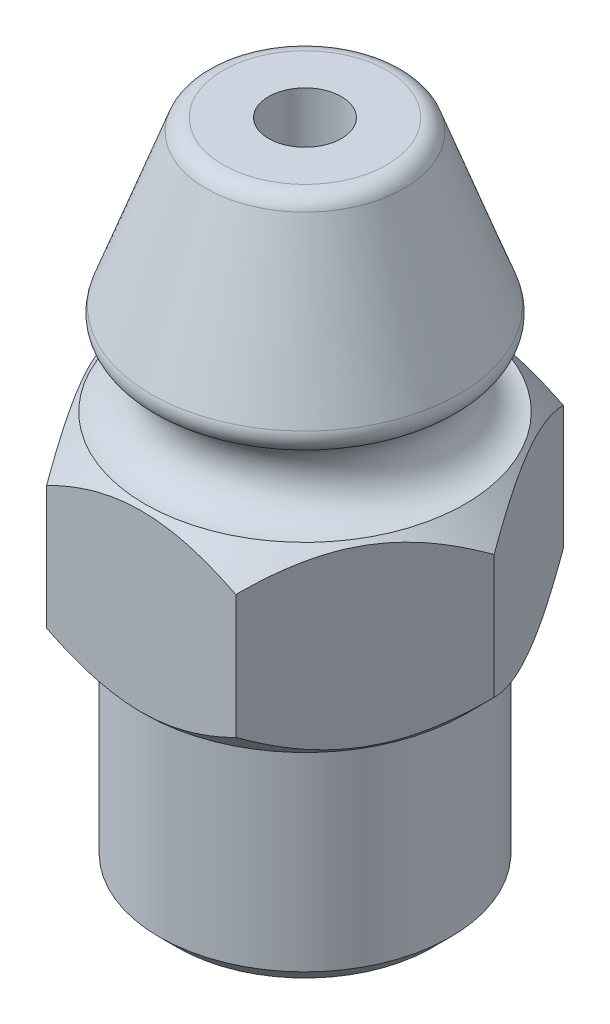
ISO-10303-21;
HEADER;
FILE_DESCRIPTION(('STEP AP214'),'2;1');
FILE_NAME('part.step','',(''),(''),'','','');
FILE_SCHEMA(('AUTOMOTIVE_DESIGN { 1 0 10303 214 1 1 1 1 }'));
ENDSEC;
DATA;
#1=APPLICATION_CONTEXT('core data for automotive mechanical design processes');
#2=APPLICATION_PROTOCOL_DEFINITION('international standard','automotive_design',2000,#1);
#3=PRODUCT_CONTEXT('',#1,'mechanical');
#4=PRODUCT('Part','Part','',(#3));
#5=PRODUCT_RELATED_PRODUCT_CATEGORY('part','',(#4));
#6=PRODUCT_DEFINITION_FORMATION('','',#4);
#7=PRODUCT_DEFINITION_CONTEXT('part definition',#1,'design');
#8=PRODUCT_DEFINITION('design','',#6,#7);
#9=PRODUCT_DEFINITION_SHAPE('','',#8);
#10=(LENGTH_UNIT() NAMED_UNIT(*) SI_UNIT(.MILLI.,.METRE.));
#11=(NAMED_UNIT(*) PLANE_ANGLE_UNIT() SI_UNIT($,.RADIAN.));
#12=(NAMED_UNIT(*) SI_UNIT($,.STERADIAN.) SOLID_ANGLE_UNIT());
#13=UNCERTAINTY_MEASURE_WITH_UNIT(LENGTH_MEASURE(1.E-05),#10,'distance_accuracy_value','');
#14=(GEOMETRIC_REPRESENTATION_CONTEXT(3) GLOBAL_UNCERTAINTY_ASSIGNED_CONTEXT((#13)) GLOBAL_UNIT_ASSIGNED_CONTEXT((#10,
#11,#12)) REPRESENTATION_CONTEXT('',''));
#15=CARTESIAN_POINT('',(0.,0.,0.));
#16=DIRECTION('',(0.,0.,1.));
#17=DIRECTION('',(1.,0.,0.));
#18=AXIS2_PLACEMENT_3D('',#15,#16,#17);
#19=CARTESIAN_POINT('',(-1.11022302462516E-13,-5.99999999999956,-5.55111512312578E-13));
#20=DIRECTION('',(0.,1.,0.));
#21=DIRECTION('',(0.,0.,1.));
#22=AXIS2_PLACEMENT_3D('',#19,#20,#21);
#23=CYLINDRICAL_SURFACE('',#22,4.);
#24=CARTESIAN_POINT('',(-1.11022302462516E-13,-5.49999999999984,0.));
#25=DIRECTION('',(0.,1.,0.));
#26=DIRECTION('',(0.,0.,1.));
#27=AXIS2_PLACEMENT_3D('',#24,#25,#26);
#28=CIRCLE('',#27,4.);
#29=CARTESIAN_POINT('',(-1.14130926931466E-13,-5.49999999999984,4.));
#30=VERTEX_POINT('',#29);
#31=EDGE_CURVE('E122',#30,#30,#28,.T.);
#32=ORIENTED_EDGE('',*,*,#31,.T.);
#33=EDGE_LOOP('',(#32));
#34=FACE_BOUND('',#33,.T.);
#35=CARTESIAN_POINT('',(0.,0.,0.));
#36=DIRECTION('',(0.,1.,0.));
#37=DIRECTION('',(0.,0.,1.));
#38=AXIS2_PLACEMENT_3D('',#35,#36,#37);
#39=CIRCLE('',#38,4.);
#40=CARTESIAN_POINT('',(0.,0.,4.));
#41=VERTEX_POINT('',#40);
#42=EDGE_CURVE('E119',#41,#41,#39,.T.);
#43=ORIENTED_EDGE('',*,*,#42,.F.);
#44=EDGE_LOOP('',(#43));
#45=FACE_BOUND('',#44,.T.);
#46=ADVANCED_FACE('F32',(#34,#45),#23,.T.);
#47=CARTESIAN_POINT('',(-1.11022302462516E-13,-5.99999999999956,-5.55111512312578E-13));
#48=DIRECTION('',(0.,1.,0.));
#49=DIRECTION('',(0.,0.,1.));
#50=AXIS2_PLACEMENT_3D('',#47,#48,#49);
#51=PLANE('',#50);
#52=CARTESIAN_POINT('',(-1.11022302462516E-13,-5.99999999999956,-5.55111512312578E-13));
#53=DIRECTION('',(0.,1.,0.));
#54=DIRECTION('',(0.,0.,1.));
#55=AXIS2_PLACEMENT_3D('',#52,#53,#54);
#56=CIRCLE('',#55,1.);
#57=CARTESIAN_POINT('',(-1.11799458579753E-13,-5.99999999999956,0.999999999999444));
#58=VERTEX_POINT('',#57);
#59=EDGE_CURVE('E395',#58,#58,#56,.T.);
#60=ORIENTED_EDGE('',*,*,#59,.T.);
#61=EDGE_LOOP('',(#60));
#62=FACE_BOUND('',#61,.T.);
#63=CARTESIAN_POINT('',(-1.11022302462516E-13,-5.99999999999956,-5.55111512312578E-13));
#64=DIRECTION('',(0.,1.,0.));
#65=DIRECTION('',(0.,0.,1.));
#66=AXIS2_PLACEMENT_3D('',#63,#64,#65);
#67=CIRCLE('',#66,3.5);
#68=CARTESIAN_POINT('',(-1.13742348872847E-13,-5.99999999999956,3.49999999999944));
#69=VERTEX_POINT('',#68);
#70=EDGE_CURVE('E125',#69,#69,#67,.F.);
#71=ORIENTED_EDGE('',*,*,#70,.T.);
#72=EDGE_LOOP('',(#71));
#73=FACE_BOUND('',#72,.T.);
#74=ADVANCED_FACE('F161',(#62,#73),#51,.F.);
#75=CARTESIAN_POINT('',(-1.11022302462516E-13,-5.49999999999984,0.));
#76=DIRECTION('',(0.,1.,0.));
#77=DIRECTION('',(0.,0.,1.));
#78=AXIS2_PLACEMENT_3D('',#75,#76,#77);
#79=CONICAL_SURFACE('',#78,4.,0.78539816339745);
#80=ORIENTED_EDGE('',*,*,#70,.F.);
#81=EDGE_LOOP('',(#80));
#82=FACE_BOUND('',#81,.T.);
#83=ORIENTED_EDGE('',*,*,#31,.F.);
#84=EDGE_LOOP('',(#83));
#85=FACE_BOUND('',#84,.T.);
#86=ADVANCED_FACE('F166',(#82,#85),#79,.T.);
#87=CARTESIAN_POINT('',(-7.79422863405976,2.22044604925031E-13,4.50000000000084));
#88=DIRECTION('',(0.,1.,0.));
#89=DIRECTION('',(0.,0.,1.));
#90=AXIS2_PLACEMENT_3D('',#87,#88,#89);
#91=PLANE('',#90);
#92=CARTESIAN_POINT('',(0.,0.,0.));
#93=DIRECTION('',(0.,-1.,0.));
#94=DIRECTION('',(0.,0.,-1.));
#95=AXIS2_PLACEMENT_3D('',#92,#93,#94);
#96=CIRCLE('',#95,4.39615242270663);
#97=CARTESIAN_POINT('',(0.,0.,-4.39615242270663));
#98=VERTEX_POINT('',#97);
#99=EDGE_CURVE('E90',#98,#98,#96,.T.);
#100=ORIENTED_EDGE('',*,*,#99,.T.);
#101=EDGE_LOOP('',(#100));
#102=FACE_BOUND('',#101,.T.);
#103=ORIENTED_EDGE('',*,*,#42,.T.);
#104=EDGE_LOOP('',(#103));
#105=FACE_BOUND('',#104,.T.);
#106=ADVANCED_FACE('F172',(#102,#105),#91,.F.);
#107=CARTESIAN_POINT('',(0.,0.,0.));
#108=DIRECTION('',(0.,1.,0.));
#109=DIRECTION('',(0.,0.,-1.));
#110=AXIS2_PLACEMENT_3D('',#107,#108,#109);
#111=CONICAL_SURFACE('',#110,4.39615242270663,0.785398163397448);
#112=ORIENTED_EDGE('',*,*,#99,.F.);
#113=EDGE_LOOP('',(#112));
#114=FACE_BOUND('',#113,.T.);
#115=CARTESIAN_POINT('',(-5.38014089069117,2.617827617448,-4.49999999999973));
#116=CARTESIAN_POINT('',(-5.24999635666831,2.51802146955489,-4.50000000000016));
#117=CARTESIAN_POINT('',(-5.11914584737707,2.41912134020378,-4.50000000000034));
#118=CARTESIAN_POINT('',(-4.85574603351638,2.22354564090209,-4.50000000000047));
#119=CARTESIAN_POINT('',(-4.72319633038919,2.12687060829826,-4.50000000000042));
#120=CARTESIAN_POINT('',(-4.45514222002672,1.93546955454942,-4.50000000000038));
#121=CARTESIAN_POINT('',(-4.31962290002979,1.84076434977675,-4.5000000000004));
#122=CARTESIAN_POINT('',(-4.04632074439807,1.65468947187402,-4.5000000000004));
#123=CARTESIAN_POINT('',(-3.90853806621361,1.56331956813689,-4.5000000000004));
#124=CARTESIAN_POINT('',(-3.62166392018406,1.37910595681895,-4.5000000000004));
#125=CARTESIAN_POINT('',(-3.47240275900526,1.28652518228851,-4.50000000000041));
#126=CARTESIAN_POINT('',(-3.17037815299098,1.10716739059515,-4.50000000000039));
#127=CARTESIAN_POINT('',(-3.01761413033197,1.02039134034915,-4.50000000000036));
#128=CARTESIAN_POINT('',(-2.70855161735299,0.854495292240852,-4.50000000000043));
#129=CARTESIAN_POINT('',(-2.5522652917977,0.775352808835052,-4.50000000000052));
#130=CARTESIAN_POINT('',(-2.23530058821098,0.626496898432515,-4.50000000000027));
#131=CARTESIAN_POINT('',(-2.07462431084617,0.556779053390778,-4.49999999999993));
#132=CARTESIAN_POINT('',(-1.76414619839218,0.435391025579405,-4.49999999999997));
#133=CARTESIAN_POINT('',(-1.61477429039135,0.38263241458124,-4.50000000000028));
#134=CARTESIAN_POINT('',(-1.31226064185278,0.289075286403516,-4.50000000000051));
#135=CARTESIAN_POINT('',(-1.15911865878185,0.248277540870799,-4.50000000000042));
#136=CARTESIAN_POINT('',(-0.852625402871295,0.181516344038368,-4.50000000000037));
#137=CARTESIAN_POINT('',(-0.699333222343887,0.155286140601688,-4.50000000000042));
#138=CARTESIAN_POINT('',(-0.390889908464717,0.118201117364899,-4.50000000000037));
#139=CARTESIAN_POINT('',(-0.235739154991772,0.107343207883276,-4.50000000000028));
#140=CARTESIAN_POINT('',(0.0682756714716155,0.101907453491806,-4.50000000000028));
#141=CARTESIAN_POINT('',(0.217127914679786,0.106660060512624,-4.50000000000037));
#142=CARTESIAN_POINT('',(0.513651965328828,0.130655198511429,-4.50000000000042));
#143=CARTESIAN_POINT('',(0.661323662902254,0.149899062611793,-4.50000000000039));
#144=CARTESIAN_POINT('',(0.956919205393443,0.202122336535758,-4.5000000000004));
#145=CARTESIAN_POINT('',(1.10479975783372,0.235342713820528,-4.50000000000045));
#146=CARTESIAN_POINT('',(1.39731083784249,0.313688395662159,-4.50000000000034));
#147=CARTESIAN_POINT('',(1.5419415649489,0.35881296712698,-4.50000000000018));
#148=CARTESIAN_POINT('',(1.83674972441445,0.462179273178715,-4.50000000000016));
#149=CARTESIAN_POINT('',(1.98669638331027,0.521071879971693,-4.50000000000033));
#150=CARTESIAN_POINT('',(2.28272734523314,0.64794743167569,-4.50000000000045));
#151=CARTESIAN_POINT('',(2.42880986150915,0.715934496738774,-4.50000000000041));
#152=CARTESIAN_POINT('',(2.71780602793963,0.859385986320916,-4.50000000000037));
#153=CARTESIAN_POINT('',(2.86070811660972,0.934873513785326,-4.50000000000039));
#154=CARTESIAN_POINT('',(3.14323571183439,1.09166360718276,-4.5000000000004));
#155=CARTESIAN_POINT('',(3.28286172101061,1.17296527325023,-4.50000000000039));
#156=CARTESIAN_POINT('',(3.55243568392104,1.33611300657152,-4.50000000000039));
#157=CARTESIAN_POINT('',(3.68252087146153,1.41773351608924,-4.50000000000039));
#158=CARTESIAN_POINT('',(3.94045649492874,1.58444271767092,-4.50000000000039));
#159=CARTESIAN_POINT('',(4.06830676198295,1.66953167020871,-4.50000000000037));
#160=CARTESIAN_POINT('',(4.32103563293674,1.84186477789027,-4.50000000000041));
#161=CARTESIAN_POINT('',(4.44592986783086,1.92908609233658,-4.50000000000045));
#162=CARTESIAN_POINT('',(4.69400587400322,2.10586228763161,-4.50000000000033));
#163=CARTESIAN_POINT('',(4.81718810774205,2.1954165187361,-4.50000000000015));
#164=CARTESIAN_POINT('',(4.93965236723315,2.28592551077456,-4.49999999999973));
#165=B_SPLINE_CURVE_WITH_KNOTS('',3,(#115,#116,#117,#118,#119,#120,#121,#122,#123,#124,#125,
#126,#127,#128,#129,#130,#131,#132,#133,#134,#135,#136,#137,#138,#139,#140,#141,#142,#143,#144,
#145,#146,#147,#148,#149,#150,#151,#152,#153,#154,#155,#156,#157,#158,#159,#160,#161,#162,#163,
#164),.UNSPECIFIED.,.F.,.F.,(4,2,2,2,2,2,2,2,2,2,2,2,2,2,2,2,2,2,2,2,2,2,2,2,4),(0.,
0.492035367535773,0.984188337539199,1.48014191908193,1.97606114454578,2.50288203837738,
3.02979046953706,3.55509613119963,4.08015468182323,4.55498998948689,5.02985592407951,
5.49571268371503,5.96147579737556,6.4075271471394,6.85361953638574,7.30774031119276,
7.7618331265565,8.24475382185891,8.72789404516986,9.21257150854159,9.69717411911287,
10.1578227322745,10.6185060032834,11.0754837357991,11.5323355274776),.UNSPECIFIED.);
#166=CARTESIAN_POINT('',(2.59807621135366,0.800000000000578,-4.50000000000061));
#167=VERTEX_POINT('',#166);
#168=CARTESIAN_POINT('',(-2.59807621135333,0.8000000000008,-4.50000000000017));
#169=VERTEX_POINT('',#168);
#170=EDGE_CURVE('E81',#167,#169,#165,.F.);
#171=ORIENTED_EDGE('',*,*,#170,.F.);
#172=CARTESIAN_POINT('',(5.19626789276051,0.80011547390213,0.000200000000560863));
#173=CARTESIAN_POINT('',(5.1515947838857,0.755446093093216,-0.0771760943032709));
#174=CARTESIAN_POINT('',(5.106578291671,0.712147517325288,-0.155146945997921));
#175=CARTESIAN_POINT('',(5.01579116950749,0.628708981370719,-0.312394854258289));
#176=CARTESIAN_POINT('',(4.97002014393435,0.588570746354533,-0.391672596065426));
#177=CARTESIAN_POINT('',(4.83104895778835,0.473179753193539,-0.632377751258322));
#178=CARTESIAN_POINT('',(4.73667231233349,0.40344300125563,-0.795842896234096));
#179=CARTESIAN_POINT('',(4.54635423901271,0.284023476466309,-1.12548346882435));
#180=CARTESIAN_POINT('',(4.45046145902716,0.234039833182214,-1.29157463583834));
#181=CARTESIAN_POINT('',(4.30504571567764,0.176220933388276,-1.54344209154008));
#182=CARTESIAN_POINT('',(4.25635970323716,0.1598151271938,-1.62776873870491));
#183=CARTESIAN_POINT('',(4.15857543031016,0.133093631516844,-1.79713606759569));
#184=CARTESIAN_POINT('',(4.10947723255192,0.12277703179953,-1.88217664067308));
#185=CARTESIAN_POINT('',(3.98983326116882,0.105479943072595,-2.08940607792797));
#186=CARTESIAN_POINT('',(3.91915857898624,0.101850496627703,-2.21181821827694));
#187=CARTESIAN_POINT('',(3.77793657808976,0.107941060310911,-2.45642189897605));
#188=CARTESIAN_POINT('',(3.70738931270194,0.11766575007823,-2.57861334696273));
#189=CARTESIAN_POINT('',(3.56695987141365,0.149891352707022,-2.82184427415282));
#190=CARTESIAN_POINT('',(3.49707852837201,0.172406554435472,-2.94288231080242));
#191=CARTESIAN_POINT('',(3.35851692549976,0.228989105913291,-3.18287804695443));
#192=CARTESIAN_POINT('',(3.28983657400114,0.263055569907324,-3.30183590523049));
#193=CARTESIAN_POINT('',(3.16791360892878,0.333142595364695,-3.51301267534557));
#194=CARTESIAN_POINT('',(3.11440108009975,0.367320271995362,-3.60569909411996));
#195=CARTESIAN_POINT('',(3.00833668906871,0.441183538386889,-3.7894080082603));
#196=CARTESIAN_POINT('',(2.95578485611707,0.480869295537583,-3.88043045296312));
#197=CARTESIAN_POINT('',(2.85180737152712,0.564859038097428,-4.06052473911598));
#198=CARTESIAN_POINT('',(2.8003787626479,0.609148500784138,-4.14960170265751));
#199=CARTESIAN_POINT('',(2.69847391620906,0.701764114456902,-4.32610607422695));
#200=CARTESIAN_POINT('',(2.64799711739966,0.750087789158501,-4.413534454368));
#201=CARTESIAN_POINT('',(2.59796074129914,0.800115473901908,-4.50019999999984));
#202=B_SPLINE_CURVE_WITH_KNOTS('',3,(#172,#173,#174,#175,#176,#177,#178,#179,#180,#181,#182,
#183,#184,#185,#186,#187,#188,#189,#190,#191,#192,#193,#194,#195,#196,#197,#198,#199,#200,#201),
.UNSPECIFIED.,.F.,.F.,(4,2,2,2,2,2,2,2,2,2,2,2,2,2,4),(0.,0.299653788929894,0.599470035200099,
1.20233965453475,1.79563573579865,2.09170187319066,2.38772374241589,2.81125251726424,
3.23492974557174,3.65908121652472,4.08320017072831,4.42009140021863,4.75699287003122,
5.09286208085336,5.42852662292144),.UNSPECIFIED.);
#203=CARTESIAN_POINT('',(5.19615242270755,0.800000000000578,6.66133814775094E-13));
#204=VERTEX_POINT('',#203);
#205=EDGE_CURVE('E84',#204,#167,#202,.T.);
#206=ORIENTED_EDGE('',*,*,#205,.F.);
#207=CARTESIAN_POINT('',(2.59796074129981,0.800115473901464,4.50020000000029));
#208=CARTESIAN_POINT('',(2.64263385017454,0.75544609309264,4.42282390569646));
#209=CARTESIAN_POINT('',(2.68765034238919,0.712147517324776,4.34485305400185));
#210=CARTESIAN_POINT('',(2.77843746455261,0.628708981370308,4.1876051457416));
#211=CARTESIAN_POINT('',(2.82420849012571,0.588570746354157,4.10832740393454));
#212=CARTESIAN_POINT('',(2.96317967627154,0.473179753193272,3.86762224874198));
#213=CARTESIAN_POINT('',(3.05755632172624,0.403443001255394,3.70415710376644));
#214=CARTESIAN_POINT('',(3.24787439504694,0.284023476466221,3.37451653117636));
#215=CARTESIAN_POINT('',(3.34376717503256,0.234039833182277,3.20842536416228));
#216=CARTESIAN_POINT('',(3.4891829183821,0.176220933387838,2.95655790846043));
#217=CARTESIAN_POINT('',(3.53786893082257,0.159815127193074,2.87223126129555));
#218=CARTESIAN_POINT('',(3.63565320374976,0.133093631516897,2.7028639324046));
#219=CARTESIAN_POINT('',(3.6847514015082,0.122777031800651,2.61782335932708));
#220=CARTESIAN_POINT('',(3.80439537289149,0.105479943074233,2.41059392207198));
#221=CARTESIAN_POINT('',(3.87507005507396,0.101850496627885,2.28818178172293));
#222=CARTESIAN_POINT('',(4.01629205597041,0.107941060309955,2.04357810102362));
#223=CARTESIAN_POINT('',(4.08683932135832,0.117665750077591,1.92138665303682));
#224=CARTESIAN_POINT('',(4.22726876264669,0.149891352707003,1.67815572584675));
#225=CARTESIAN_POINT('',(4.29715010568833,0.172406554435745,1.55711768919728));
#226=CARTESIAN_POINT('',(4.43571170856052,0.228989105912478,1.31712195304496));
#227=CARTESIAN_POINT('',(4.50439206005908,0.263055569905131,1.19816409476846));
#228=CARTESIAN_POINT('',(4.62631502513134,0.33314259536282,0.986987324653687));
#229=CARTESIAN_POINT('',(4.67982755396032,0.367320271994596,0.894300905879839));
#230=CARTESIAN_POINT('',(4.78589194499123,0.441183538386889,0.710591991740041));
#231=CARTESIAN_POINT('',(4.8384437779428,0.480869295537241,0.619569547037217));
#232=CARTESIAN_POINT('',(4.94242126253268,0.564859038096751,0.439475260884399));
#233=CARTESIAN_POINT('',(4.99384987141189,0.609148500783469,0.350398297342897));
#234=CARTESIAN_POINT('',(5.09575471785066,0.70176411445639,0.17389392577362));
#235=CARTESIAN_POINT('',(5.14623151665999,0.750087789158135,0.0864655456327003));
#236=CARTESIAN_POINT('',(5.1962678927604,0.800115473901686,-0.00019999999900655));
#237=B_SPLINE_CURVE_WITH_KNOTS('',3,(#207,#208,#209,#210,#211,#212,#213,#214,#215,#216,#217,
#218,#219,#220,#221,#222,#223,#224,#225,#226,#227,#228,#229,#230,#231,#232,#233,#234,#235,#236),
.UNSPECIFIED.,.F.,.F.,(4,2,2,2,2,2,2,2,2,2,2,2,2,2,4),(0.,0.299653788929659,0.599470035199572,
1.20233965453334,1.79563573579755,2.09170187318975,2.38772374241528,2.81125251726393,
3.2349297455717,3.65908121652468,4.0832001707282,4.42009140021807,4.75699287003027,
5.0928620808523,5.42852662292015),.UNSPECIFIED.);
#238=CARTESIAN_POINT('',(2.59807621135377,0.79999999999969,4.49999999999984));
#239=VERTEX_POINT('',#238);
#240=EDGE_CURVE('E99',#239,#204,#237,.T.);
#241=ORIENTED_EDGE('',*,*,#240,.F.);
#242=CARTESIAN_POINT('',(-5.38014089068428,2.61782761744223,4.50000000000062));
#243=CARTESIAN_POINT('',(-5.24999635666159,2.51802146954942,4.50000000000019));
#244=CARTESIAN_POINT('',(-5.11914584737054,2.41912134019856,4.50000000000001));
#245=CARTESIAN_POINT('',(-4.85574603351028,2.22354564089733,4.49999999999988));
#246=CARTESIAN_POINT('',(-4.72319633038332,2.12687060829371,4.49999999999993));
#247=CARTESIAN_POINT('',(-4.45514222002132,1.93546955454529,4.49999999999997));
#248=CARTESIAN_POINT('',(-4.31962290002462,1.84076434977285,4.49999999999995));
#249=CARTESIAN_POINT('',(-4.04632074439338,1.65468947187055,4.49999999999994));
#250=CARTESIAN_POINT('',(-3.90853806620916,1.56331956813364,4.49999999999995));
#251=CARTESIAN_POINT('',(-3.62166392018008,1.37910595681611,4.49999999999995));
#252=CARTESIAN_POINT('',(-3.47240275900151,1.28652518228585,4.49999999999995));
#253=CARTESIAN_POINT('',(-3.17037815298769,1.1071673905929,4.49999999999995));
#254=CARTESIAN_POINT('',(-3.01761413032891,1.0203913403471,4.49999999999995));
#255=CARTESIAN_POINT('',(-2.70855161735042,0.854495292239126,4.49999999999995));
#256=CARTESIAN_POINT('',(-2.5522652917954,0.775352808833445,4.49999999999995));
#257=CARTESIAN_POINT('',(-2.23530058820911,0.626496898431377,4.49999999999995));
#258=CARTESIAN_POINT('',(-2.07462431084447,0.55677905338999,4.49999999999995));
#259=CARTESIAN_POINT('',(-1.76414619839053,0.435391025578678,4.49999999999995));
#260=CARTESIAN_POINT('',(-1.61477429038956,0.382632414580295,4.49999999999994));
#261=CARTESIAN_POINT('',(-1.31226064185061,0.28907528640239,4.49999999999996));
#262=CARTESIAN_POINT('',(-1.15911865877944,0.24827754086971,4.49999999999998));
#263=CARTESIAN_POINT('',(-0.852625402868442,0.181516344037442,4.49999999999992));
#264=CARTESIAN_POINT('',(-0.699333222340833,0.155286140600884,4.49999999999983));
#265=CARTESIAN_POINT('',(-0.390889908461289,0.118201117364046,4.50000000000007));
#266=CARTESIAN_POINT('',(-0.235739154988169,0.107343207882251,4.50000000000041));
#267=CARTESIAN_POINT('',(0.0682756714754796,0.10190745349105,4.50000000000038));
#268=CARTESIAN_POINT('',(0.217127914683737,0.106660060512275,4.50000000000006));
#269=CARTESIAN_POINT('',(0.513651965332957,0.130655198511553,4.49999999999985));
#270=CARTESIAN_POINT('',(0.661323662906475,0.149899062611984,4.49999999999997));
#271=CARTESIAN_POINT('',(0.956919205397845,0.202122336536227,4.49999999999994));
#272=CARTESIAN_POINT('',(1.10479975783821,0.235342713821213,4.49999999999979));
#273=CARTESIAN_POINT('',(1.39731083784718,0.313688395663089,4.50000000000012));
#274=CARTESIAN_POINT('',(1.54194156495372,0.358812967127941,4.5000000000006));
#275=CARTESIAN_POINT('',(1.83674972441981,0.462179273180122,4.50000000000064));
#276=CARTESIAN_POINT('',(1.98669638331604,0.52107187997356,4.50000000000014));
#277=CARTESIAN_POINT('',(2.28272734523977,0.647947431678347,4.49999999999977));
#278=CARTESIAN_POINT('',(2.42880986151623,0.715934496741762,4.49999999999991));
#279=CARTESIAN_POINT('',(2.7178060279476,0.85938598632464,4.50000000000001));
#280=CARTESIAN_POINT('',(2.86070811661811,0.934873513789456,4.49999999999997));
#281=CARTESIAN_POINT('',(3.14323571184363,1.0916636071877,4.49999999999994));
#282=CARTESIAN_POINT('',(3.28286172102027,1.17296527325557,4.49999999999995));
#283=CARTESIAN_POINT('',(3.55243568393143,1.33611300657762,4.49999999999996));
#284=CARTESIAN_POINT('',(3.68252087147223,1.41773351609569,4.49999999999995));
#285=CARTESIAN_POINT('',(3.94045649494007,1.58444271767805,4.49999999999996));
#286=CARTESIAN_POINT('',(4.06830676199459,1.66953167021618,4.49999999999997));
#287=CARTESIAN_POINT('',(4.32103563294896,1.84186477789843,4.49999999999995));
#288=CARTESIAN_POINT('',(4.44592986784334,1.92908609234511,4.49999999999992));
#289=CARTESIAN_POINT('',(4.69400587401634,2.10586228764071,4.5));
#290=CARTESIAN_POINT('',(4.81718810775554,2.1954165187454,4.50000000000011));
#291=CARTESIAN_POINT('',(4.93965236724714,2.28592551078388,4.50000000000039));
#292=B_SPLINE_CURVE_WITH_KNOTS('',3,(#242,#243,#244,#245,#246,#247,#248,#249,#250,#251,#252,
#253,#254,#255,#256,#257,#258,#259,#260,#261,#262,#263,#264,#265,#266,#267,#268,#269,#270,#271,
#272,#273,#274,#275,#276,#277,#278,#279,#280,#281,#282,#283,#284,#285,#286,#287,#288,#289,#290,
#291),.UNSPECIFIED.,.F.,.F.,(4,2,2,2,2,2,2,2,2,2,2,2,2,2,2,2,2,2,2,2,2,2,2,2,4),(0.,
0.492035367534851,0.984188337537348,1.48014191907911,1.97606114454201,2.50288203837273,
3.02979046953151,3.55509613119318,4.08015468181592,4.55498998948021,5.02985592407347,
5.49571268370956,5.96147579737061,6.40752714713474,6.8536195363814,7.30774031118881,
7.76183312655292,8.24475382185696,8.72789404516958,9.212571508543,9.69717411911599,
10.157822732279,10.6185060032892,11.0754837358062,11.5323355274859),.UNSPECIFIED.);
#293=CARTESIAN_POINT('',(-2.59807621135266,0.799999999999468,4.50000000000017));
#294=VERTEX_POINT('',#293);
#295=EDGE_CURVE('E220',#294,#239,#292,.T.);
#296=ORIENTED_EDGE('',*,*,#295,.F.);
#297=CARTESIAN_POINT('',(-5.19626789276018,0.800115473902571,-0.00019999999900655));
#298=CARTESIAN_POINT('',(-5.15159478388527,0.755446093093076,0.0771760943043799));
#299=CARTESIAN_POINT('',(-5.10657829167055,0.712147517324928,0.155146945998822));
#300=CARTESIAN_POINT('',(-5.01579116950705,0.628708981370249,0.312394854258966));
#301=CARTESIAN_POINT('',(-4.97002014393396,0.588570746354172,0.391672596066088));
#302=CARTESIAN_POINT('',(-4.83104895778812,0.47317975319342,0.63237775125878));
#303=CARTESIAN_POINT('',(-4.73667231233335,0.403443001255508,0.795842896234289));
#304=CARTESIAN_POINT('',(-4.54635423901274,0.284023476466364,1.12548346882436));
#305=CARTESIAN_POINT('',(-4.45046145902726,0.234039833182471,1.29157463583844));
#306=CARTESIAN_POINT('',(-4.30504571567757,0.17622093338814,1.54344209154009));
#307=CARTESIAN_POINT('',(-4.25635970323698,0.159815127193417,1.62776873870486));
#308=CARTESIAN_POINT('',(-4.15857543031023,0.133093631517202,1.79713606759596));
#309=CARTESIAN_POINT('',(-4.10947723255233,0.122777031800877,1.88217664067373));
#310=CARTESIAN_POINT('',(-3.98983326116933,0.105479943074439,2.0894060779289));
#311=CARTESIAN_POINT('',(-3.91915857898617,0.101850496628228,2.21181821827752));
#312=CARTESIAN_POINT('',(-3.77793657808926,0.107941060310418,2.45642189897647));
#313=CARTESIAN_POINT('',(-3.70738931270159,0.117665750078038,2.57861334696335));
#314=CARTESIAN_POINT('',(-3.56695987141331,0.149891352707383,2.82184427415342));
#315=CARTESIAN_POINT('',(-3.49707852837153,0.172406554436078,2.94288231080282));
#316=CARTESIAN_POINT('',(-3.35851692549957,0.228989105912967,3.18287804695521));
#317=CARTESIAN_POINT('',(-3.28983657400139,0.263055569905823,3.30183590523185));
#318=CARTESIAN_POINT('',(-3.16791360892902,0.333142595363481,3.51301267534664));
#319=CARTESIAN_POINT('',(-3.11440108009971,0.367320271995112,3.60569909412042));
#320=CARTESIAN_POINT('',(-3.00833668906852,0.441183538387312,3.78940800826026));
#321=CARTESIAN_POINT('',(-2.95578485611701,0.480869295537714,3.88043045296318));
#322=CARTESIAN_POINT('',(-2.85180737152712,0.564859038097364,4.06052473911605));
#323=CARTESIAN_POINT('',(-2.80037876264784,0.609148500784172,4.14960170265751));
#324=CARTESIAN_POINT('',(-2.69847391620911,0.701764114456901,4.32610607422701));
#325=CARTESIAN_POINT('',(-2.64799711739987,0.750087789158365,4.41353445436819));
#326=CARTESIAN_POINT('',(-2.59796074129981,0.800115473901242,4.50020000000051));
#327=B_SPLINE_CURVE_WITH_KNOTS('',3,(#297,#298,#299,#300,#301,#302,#303,#304,#305,#306,#307,
#308,#309,#310,#311,#312,#313,#314,#315,#316,#317,#318,#319,#320,#321,#322,#323,#324,#325,#326),
.UNSPECIFIED.,.F.,.F.,(4,2,2,2,2,2,2,2,2,2,2,2,2,2,4),(0.,0.299653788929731,0.5994700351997,
1.20233965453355,1.79563573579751,2.09170187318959,2.387723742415,2.81125251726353,
3.23492974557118,3.65908121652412,4.08320017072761,4.42009140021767,4.75699287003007,
5.09286208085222,5.42852662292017),.UNSPECIFIED.);
#328=CARTESIAN_POINT('',(-5.19615242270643,0.799999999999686,5.55111512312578E-13));
#329=VERTEX_POINT('',#328);
#330=EDGE_CURVE('E226',#329,#294,#327,.T.);
#331=ORIENTED_EDGE('',*,*,#330,.F.);
#332=CARTESIAN_POINT('',(-2.59796074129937,0.800115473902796,-4.50020000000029));
#333=CARTESIAN_POINT('',(-2.64263385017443,0.755446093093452,-4.42282390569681));
#334=CARTESIAN_POINT('',(-2.68765034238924,0.712147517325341,-4.3448530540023));
#335=CARTESIAN_POINT('',(-2.77843746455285,0.628708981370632,-4.18760514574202));
#336=CARTESIAN_POINT('',(-2.82420849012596,0.588570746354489,-4.10832740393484));
#337=CARTESIAN_POINT('',(-2.96317967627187,0.473179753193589,-3.86762224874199));
#338=CARTESIAN_POINT('',(-3.05755632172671,0.403443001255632,-3.70415710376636));
#339=CARTESIAN_POINT('',(-3.24787439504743,0.284023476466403,-3.37451653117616));
#340=CARTESIAN_POINT('',(-3.34376717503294,0.234039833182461,-3.20842536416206));
#341=CARTESIAN_POINT('',(-3.48918291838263,0.17622093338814,-2.95655790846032));
#342=CARTESIAN_POINT('',(-3.53786893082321,0.159815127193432,-2.87223126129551));
#343=CARTESIAN_POINT('',(-3.63565320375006,0.133093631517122,-2.7028639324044));
#344=CARTESIAN_POINT('',(-3.68475140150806,0.122777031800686,-2.61782335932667));
#345=CARTESIAN_POINT('',(-3.80439537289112,0.105479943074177,-2.41059392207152));
#346=CARTESIAN_POINT('',(-3.87507005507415,0.101850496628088,-2.28818178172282));
#347=CARTESIAN_POINT('',(-4.01629205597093,0.107941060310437,-2.04357810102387));
#348=CARTESIAN_POINT('',(-4.08683932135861,0.117665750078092,-1.92138665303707));
#349=CARTESIAN_POINT('',(-4.22726876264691,0.149891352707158,-1.678155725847));
#350=CARTESIAN_POINT('',(-4.2971501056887,0.172406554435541,-1.55711768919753));
#351=CARTESIAN_POINT('',(-4.43571170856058,0.22898910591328,-1.31712195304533));
#352=CARTESIAN_POINT('',(-4.50439206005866,0.263055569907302,-1.19816409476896));
#353=CARTESIAN_POINT('',(-4.62631502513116,0.333142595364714,-0.986987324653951));
#354=CARTESIAN_POINT('',(-4.67982755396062,0.367320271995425,-0.894300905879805));
#355=CARTESIAN_POINT('',(-4.78589194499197,0.441183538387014,-0.710591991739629));
#356=CARTESIAN_POINT('',(-4.83844377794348,0.480869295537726,-0.619569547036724));
#357=CARTESIAN_POINT('',(-4.94242126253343,0.564859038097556,-0.439475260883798));
#358=CARTESIAN_POINT('',(-4.99384987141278,0.609148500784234,-0.350398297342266));
#359=CARTESIAN_POINT('',(-5.09575471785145,0.701764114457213,-0.173893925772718));
#360=CARTESIAN_POINT('',(-5.14623151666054,0.750087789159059,-0.0864655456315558));
#361=CARTESIAN_POINT('',(-5.19626789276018,0.800115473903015,0.000200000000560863));
#362=B_SPLINE_CURVE_WITH_KNOTS('',3,(#332,#333,#334,#335,#336,#337,#338,#339,#340,#341,#342,
#343,#344,#345,#346,#347,#348,#349,#350,#351,#352,#353,#354,#355,#356,#357,#358,#359,#360,#361),
.UNSPECIFIED.,.F.,.F.,(4,2,2,2,2,2,2,2,2,2,2,2,2,2,4),(0.,0.299653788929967,0.599470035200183,
1.20233965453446,1.79563573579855,2.09170187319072,2.38772374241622,2.81125251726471,
3.23492974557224,3.65908121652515,4.08320017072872,4.4200914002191,4.75699287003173,
5.09286208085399,5.42852662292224),.UNSPECIFIED.);
#363=EDGE_CURVE('E46',#169,#329,#362,.T.);
#364=ORIENTED_EDGE('',*,*,#363,.F.);
#365=EDGE_LOOP('',(#171,#206,#241,#296,#331,#364));
#366=FACE_BOUND('',#365,.T.);
#367=ADVANCED_FACE('F83',(#114,#366),#111,.T.);
#368=CARTESIAN_POINT('',(2.22044604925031E-13,5.00000000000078,-4.44089209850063E-13));
#369=DIRECTION('',(0.,-1.,0.));
#370=DIRECTION('',(0.,0.,-1.));
#371=AXIS2_PLACEMENT_3D('',#368,#369,#370);
#372=CONICAL_SURFACE('',#371,4.39615242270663,0.785398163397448);
#373=CARTESIAN_POINT('',(2.22044604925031E-13,5.00000000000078,-4.44089209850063E-13));
#374=DIRECTION('',(0.,1.,0.));
#375=DIRECTION('',(0.,0.,1.));
#376=AXIS2_PLACEMENT_3D('',#373,#374,#375);
#377=CIRCLE('',#376,4.39615242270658);
#378=CARTESIAN_POINT('',(2.18628108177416E-13,5.00000000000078,4.39615242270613));
#379=VERTEX_POINT('',#378);
#380=EDGE_CURVE('E399',#379,#379,#377,.T.);
#381=ORIENTED_EDGE('',*,*,#380,.F.);
#382=EDGE_LOOP('',(#381));
#383=FACE_BOUND('',#382,.T.);
#384=CARTESIAN_POINT('',(-2.59796074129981,4.19988452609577,4.50020000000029));
#385=CARTESIAN_POINT('',(-2.64263385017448,4.24455390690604,4.42282390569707));
#386=CARTESIAN_POINT('',(-2.68765034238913,4.28785248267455,4.34485305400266));
#387=CARTESIAN_POINT('',(-2.77843746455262,4.37129101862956,4.18760514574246));
#388=CARTESIAN_POINT('',(-2.82420849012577,4.41142925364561,4.10832740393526));
#389=CARTESIAN_POINT('',(-2.96317967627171,4.52682024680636,3.86762224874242));
#390=CARTESIAN_POINT('',(-3.05755632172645,4.59655699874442,3.70415710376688));
#391=CARTESIAN_POINT('',(-3.24787439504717,4.71597652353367,3.37451653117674));
#392=CARTESIAN_POINT('',(-3.34376717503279,4.76596016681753,3.20842536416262));
#393=CARTESIAN_POINT('',(-3.48918291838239,4.82377906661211,2.95655790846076));
#394=CARTESIAN_POINT('',(-3.5378689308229,4.84018487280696,2.87223126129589));
#395=CARTESIAN_POINT('',(-3.63565320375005,4.86690636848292,2.7028639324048));
#396=CARTESIAN_POINT('',(-3.68475140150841,4.87722296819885,2.61782335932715));
#397=CARTESIAN_POINT('',(-3.80439537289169,4.89452005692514,2.41059392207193));
#398=CARTESIAN_POINT('',(-3.87507005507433,4.89814950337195,2.28818178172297));
#399=CARTESIAN_POINT('',(-4.01629205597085,4.89205893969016,2.04357810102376));
#400=CARTESIAN_POINT('',(-4.08683932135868,4.88233424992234,1.92138665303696));
#401=CARTESIAN_POINT('',(-4.22726876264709,4.85010864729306,1.67815572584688));
#402=CARTESIAN_POINT('',(-4.29715010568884,4.82759344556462,1.55711768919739));
#403=CARTESIAN_POINT('',(-4.4357117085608,4.77101089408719,1.31712195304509));
#404=CARTESIAN_POINT('',(-4.504392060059,4.73694443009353,1.19816409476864));
#405=CARTESIAN_POINT('',(-4.62631502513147,4.66685740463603,0.986987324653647));
#406=CARTESIAN_POINT('',(-4.67982755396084,4.63267972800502,0.894300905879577));
#407=CARTESIAN_POINT('',(-4.78589194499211,4.55881646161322,0.710591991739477));
#408=CARTESIAN_POINT('',(-4.83844377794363,4.5191307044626,0.619569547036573));
#409=CARTESIAN_POINT('',(-4.94242126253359,4.43514096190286,0.43947526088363));
#410=CARTESIAN_POINT('',(-4.99384987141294,4.39085149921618,0.350398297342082));
#411=CARTESIAN_POINT('',(-5.09575471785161,4.29823588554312,0.173893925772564));
#412=CARTESIAN_POINT('',(-5.14623151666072,4.24991221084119,0.0864655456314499));
#413=CARTESIAN_POINT('',(-5.1962678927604,4.1998845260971,-0.000200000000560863));
#414=B_SPLINE_CURVE_WITH_KNOTS('',3,(#384,#385,#386,#387,#388,#389,#390,#391,#392,#393,#394,
#395,#396,#397,#398,#399,#400,#401,#402,#403,#404,#405,#406,#407,#408,#409,#410,#411,#412,#413),
.UNSPECIFIED.,.F.,.F.,(4,2,2,2,2,2,2,2,2,2,2,2,2,2,4),(0.,0.299653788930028,0.59947003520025,
1.2023396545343,1.79563573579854,2.09170187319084,2.38772374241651,2.8112525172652,
3.23492974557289,3.65908121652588,4.08320017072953,4.42009140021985,4.75699287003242,
5.09286208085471,5.42852662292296),.UNSPECIFIED.);
#415=CARTESIAN_POINT('',(-2.59807621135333,4.19999999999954,4.50000000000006));
#416=VERTEX_POINT('',#415);
#417=CARTESIAN_POINT('',(-5.19615242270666,4.19999999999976,4.44089209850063E-13));
#418=VERTEX_POINT('',#417);
#419=EDGE_CURVE('E245',#416,#418,#414,.T.);
#420=ORIENTED_EDGE('',*,*,#419,.F.);
#421=CARTESIAN_POINT('',(-5.38014089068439,2.38217238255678,4.49999999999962));
#422=CARTESIAN_POINT('',(-5.24999635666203,2.48197853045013,4.49999999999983));
#423=CARTESIAN_POINT('',(-5.11914584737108,2.58087865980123,4.49999999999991));
#424=CARTESIAN_POINT('',(-4.85574603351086,2.77645435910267,4.49999999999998));
#425=CARTESIAN_POINT('',(-4.72319633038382,2.87312939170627,4.49999999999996));
#426=CARTESIAN_POINT('',(-4.45514222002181,3.06453044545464,4.49999999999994));
#427=CARTESIAN_POINT('',(-4.31962290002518,3.15923565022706,4.49999999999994));
#428=CARTESIAN_POINT('',(-4.04632074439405,3.34531052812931,4.49999999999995));
#429=CARTESIAN_POINT('',(-3.90853806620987,3.43668043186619,4.49999999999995));
#430=CARTESIAN_POINT('',(-3.62166392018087,3.62089404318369,4.49999999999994));
#431=CARTESIAN_POINT('',(-3.47240275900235,3.71347481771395,4.49999999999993));
#432=CARTESIAN_POINT('',(-3.17037815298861,3.89283260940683,4.49999999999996));
#433=CARTESIAN_POINT('',(-3.01761413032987,3.97960865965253,4.5));
#434=CARTESIAN_POINT('',(-2.70855161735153,4.14550470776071,4.4999999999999));
#435=CARTESIAN_POINT('',(-2.55226529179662,4.2246471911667,4.49999999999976));
#436=CARTESIAN_POINT('',(-2.23530058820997,4.37350310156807,4.50000000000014));
#437=CARTESIAN_POINT('',(-2.07462431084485,4.44322094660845,4.50000000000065));
#438=CARTESIAN_POINT('',(-1.76414619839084,4.56460897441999,4.50000000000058));
#439=CARTESIAN_POINT('',(-1.61477429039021,4.6173675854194,4.5000000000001));
#440=CARTESIAN_POINT('',(-1.31226064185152,4.71092471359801,4.4999999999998));
#441=CARTESIAN_POINT('',(-1.15911865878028,4.75172245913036,4.49999999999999));
#442=CARTESIAN_POINT('',(-0.852625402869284,4.81848365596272,4.49999999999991));
#443=CARTESIAN_POINT('',(-0.69933322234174,4.84471385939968,4.49999999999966));
#444=CARTESIAN_POINT('',(-0.390889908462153,4.8817988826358,4.50000000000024));
#445=CARTESIAN_POINT('',(-0.235739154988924,4.89265679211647,4.50000000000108));
#446=CARTESIAN_POINT('',(0.0682756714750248,4.89809254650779,4.50000000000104));
#447=CARTESIAN_POINT('',(0.217127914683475,4.89333993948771,4.50000000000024));
#448=CARTESIAN_POINT('',(0.513651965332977,4.8693448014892,4.49999999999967));
#449=CARTESIAN_POINT('',(0.661323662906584,4.85010093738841,4.4999999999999));
#450=CARTESIAN_POINT('',(0.956919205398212,4.79787766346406,4.5));
#451=CARTESIAN_POINT('',(1.10479975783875,4.76465728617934,4.49999999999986));
#452=CARTESIAN_POINT('',(1.39731083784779,4.68631160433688,4.50000000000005));
#453=CARTESIAN_POINT('',(1.54194156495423,4.64118703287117,4.50000000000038));
#454=CARTESIAN_POINT('',(1.83674972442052,4.53782072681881,4.50000000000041));
#455=CARTESIAN_POINT('',(1.98669638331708,4.47892812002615,4.50000000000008));
#456=CARTESIAN_POINT('',(2.28272734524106,4.3520525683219,4.49999999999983));
#457=CARTESIAN_POINT('',(2.42880986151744,4.28406550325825,4.49999999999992));
#458=CARTESIAN_POINT('',(2.71780602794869,4.14061401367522,4.49999999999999));
#459=CARTESIAN_POINT('',(2.86070811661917,4.06512648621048,4.49999999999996));
#460=CARTESIAN_POINT('',(3.14323571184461,3.90833639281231,4.49999999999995));
#461=CARTESIAN_POINT('',(3.2828617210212,3.82703472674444,4.49999999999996));
#462=CARTESIAN_POINT('',(3.55243568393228,3.66388699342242,4.49999999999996));
#463=CARTESIAN_POINT('',(3.68252087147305,3.58226648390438,4.49999999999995));
#464=CARTESIAN_POINT('',(3.94045649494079,3.41555728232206,4.49999999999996));
#465=CARTESIAN_POINT('',(4.06830676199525,3.33046832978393,4.49999999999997));
#466=CARTESIAN_POINT('',(4.32103563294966,3.15813522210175,4.49999999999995));
#467=CARTESIAN_POINT('',(4.44592986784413,3.07091390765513,4.49999999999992));
#468=CARTESIAN_POINT('',(4.69400587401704,2.89413771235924,4.5));
#469=CARTESIAN_POINT('',(4.81718810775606,2.8045834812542,4.50000000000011));
#470=CARTESIAN_POINT('',(4.93965236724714,2.7140744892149,4.50000000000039));
#471=B_SPLINE_CURVE_WITH_KNOTS('',3,(#421,#422,#423,#424,#425,#426,#427,#428,#429,#430,#431,
#432,#433,#434,#435,#436,#437,#438,#439,#440,#441,#442,#443,#444,#445,#446,#447,#448,#449,#450,
#451,#452,#453,#454,#455,#456,#457,#458,#459,#460,#461,#462,#463,#464,#465,#466,#467,#468,#469,
#470),.UNSPECIFIED.,.F.,.F.,(4,2,2,2,2,2,2,2,2,2,2,2,2,2,2,2,2,2,2,2,2,2,2,2,4),(0.,
0.492035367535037,0.984188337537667,1.48014191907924,1.97606114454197,2.50288203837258,
3.02979046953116,3.55509613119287,4.08015468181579,4.55498998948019,5.02985592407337,
5.49571268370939,5.96147579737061,6.40752714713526,6.85361953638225,7.30774031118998,
7.76183312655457,8.24475382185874,8.72789404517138,9.21257150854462,9.69717411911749,
10.1578227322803,10.6185060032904,11.0754837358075,11.5323355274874),.UNSPECIFIED.);
#472=CARTESIAN_POINT('',(2.59807621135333,4.19999999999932,4.49999999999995));
#473=VERTEX_POINT('',#472);
#474=EDGE_CURVE('E251',#473,#416,#471,.F.);
#475=ORIENTED_EDGE('',*,*,#474,.F.);
#476=CARTESIAN_POINT('',(5.19626789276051,4.19988452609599,-0.00019999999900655));
#477=CARTESIAN_POINT('',(5.15159478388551,4.24455390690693,0.0771760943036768));
#478=CARTESIAN_POINT('',(5.10657829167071,4.28785248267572,0.155146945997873));
#479=CARTESIAN_POINT('',(5.0157911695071,4.37129101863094,0.312394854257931));
#480=CARTESIAN_POINT('',(4.97002014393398,4.41142925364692,0.391672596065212));
#481=CARTESIAN_POINT('',(4.83104895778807,4.52682024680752,0.632377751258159));
#482=CARTESIAN_POINT('',(4.73667231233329,4.5965569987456,0.795842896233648));
#483=CARTESIAN_POINT('',(4.54635423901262,4.71597652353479,1.12548346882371));
#484=CARTESIAN_POINT('',(4.45046145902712,4.76596016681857,1.2915746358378));
#485=CARTESIAN_POINT('',(4.30504571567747,4.82377906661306,1.5434420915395));
#486=CARTESIAN_POINT('',(4.2563597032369,4.84018487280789,1.62776873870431));
#487=CARTESIAN_POINT('',(4.15857543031,4.86690636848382,1.79713606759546));
#488=CARTESIAN_POINT('',(4.10947723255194,4.87722296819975,1.88217664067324));
#489=CARTESIAN_POINT('',(3.98983326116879,4.89452005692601,2.08940607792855));
#490=CARTESIAN_POINT('',(3.91915857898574,4.89814950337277,2.21181821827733));
#491=CARTESIAN_POINT('',(3.7779365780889,4.89205893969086,2.45642189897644));
#492=CARTESIAN_POINT('',(3.70738931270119,4.88233424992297,2.57861334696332));
#493=CARTESIAN_POINT('',(3.56695987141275,4.85010864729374,2.82184427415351));
#494=CARTESIAN_POINT('',(3.49707852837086,4.82759344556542,2.94288231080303));
#495=CARTESIAN_POINT('',(3.35851692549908,4.77101089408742,3.18287804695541));
#496=CARTESIAN_POINT('',(3.28983657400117,4.73694443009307,3.30183590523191));
#497=CARTESIAN_POINT('',(3.16791360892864,4.66685740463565,3.51301267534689));
#498=CARTESIAN_POINT('',(3.11440108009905,4.63267972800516,3.60569909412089));
#499=CARTESIAN_POINT('',(3.00833668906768,4.55881646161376,3.78940800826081));
#500=CARTESIAN_POINT('',(2.95578485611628,4.519130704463,3.88043045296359));
#501=CARTESIAN_POINT('',(2.85180737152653,4.43514096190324,4.06052473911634));
#502=CARTESIAN_POINT('',(2.80037876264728,4.39085149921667,4.14960170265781));
#503=CARTESIAN_POINT('',(2.69847391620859,4.29823588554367,4.326106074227));
#504=CARTESIAN_POINT('',(2.64799711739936,4.2499122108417,4.41353445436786));
#505=CARTESIAN_POINT('',(2.59796074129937,4.19988452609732,4.5001999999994));
#506=B_SPLINE_CURVE_WITH_KNOTS('',3,(#476,#477,#478,#479,#480,#481,#482,#483,#484,#485,#486,
#487,#488,#489,#490,#491,#492,#493,#494,#495,#496,#497,#498,#499,#500,#501,#502,#503,#504,#505),
.UNSPECIFIED.,.F.,.F.,(4,2,2,2,2,2,2,2,2,2,2,2,2,2,4),(0.,0.29965378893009,0.599470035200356,
1.20233965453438,1.79563573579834,2.09170187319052,2.38772374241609,2.81125251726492,
3.2349297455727,3.65908121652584,4.08320017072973,4.42009140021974,4.75699287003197,
5.09286208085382,5.42852662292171),.UNSPECIFIED.);
#507=CARTESIAN_POINT('',(5.19615242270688,4.19999999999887,1.11022302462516E-13));
#508=VERTEX_POINT('',#507);
#509=EDGE_CURVE('E268',#508,#473,#506,.T.);
#510=ORIENTED_EDGE('',*,*,#509,.F.);
#511=CARTESIAN_POINT('',(2.59796074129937,4.19988452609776,-4.50020000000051));
#512=CARTESIAN_POINT('',(2.64263385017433,4.24455390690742,-4.42282390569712));
#513=CARTESIAN_POINT('',(2.68765034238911,4.28785248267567,-4.34485305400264));
#514=CARTESIAN_POINT('',(2.7784374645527,4.37129101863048,-4.18760514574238));
#515=CARTESIAN_POINT('',(2.82420849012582,4.4114292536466,-4.10832740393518));
#516=CARTESIAN_POINT('',(2.96317967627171,4.52682024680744,-3.86762224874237));
#517=CARTESIAN_POINT('',(3.05755632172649,4.59655699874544,-3.70415710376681));
#518=CARTESIAN_POINT('',(3.24787439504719,4.71597652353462,-3.37451653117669));
#519=CARTESIAN_POINT('',(3.34376717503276,4.76596016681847,-3.2084253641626));
#520=CARTESIAN_POINT('',(3.48918291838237,4.82377906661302,-2.95655790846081));
#521=CARTESIAN_POINT('',(3.53786893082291,4.84018487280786,-2.87223126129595));
#522=CARTESIAN_POINT('',(3.63565320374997,4.86690636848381,-2.70286393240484));
#523=CARTESIAN_POINT('',(3.68475140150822,4.87722296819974,-2.61782335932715));
#524=CARTESIAN_POINT('',(3.8043953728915,4.89452005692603,-2.41059392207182));
#525=CARTESIAN_POINT('',(3.87507005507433,4.89814950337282,-2.28818178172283));
#526=CARTESIAN_POINT('',(4.01629205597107,4.89205893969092,-2.04357810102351));
#527=CARTESIAN_POINT('',(4.08683932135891,4.88233424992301,-1.92138665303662));
#528=CARTESIAN_POINT('',(4.22726876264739,4.8501086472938,-1.6781557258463));
#529=CARTESIAN_POINT('',(4.29715010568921,4.82759344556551,-1.55711768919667));
#530=CARTESIAN_POINT('',(4.43571170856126,4.77101089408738,-1.31712195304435));
#531=CARTESIAN_POINT('',(4.50439206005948,4.73694443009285,-1.19816409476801));
#532=CARTESIAN_POINT('',(4.62631502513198,4.66685740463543,-0.986987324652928));
#533=CARTESIAN_POINT('',(4.67982755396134,4.63267972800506,-0.894300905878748));
#534=CARTESIAN_POINT('',(4.78589194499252,4.55881646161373,-0.71059199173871));
#535=CARTESIAN_POINT('',(4.83844377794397,4.51913070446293,-0.619569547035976));
#536=CARTESIAN_POINT('',(4.94242126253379,4.43514096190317,-0.439475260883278));
#537=CARTESIAN_POINT('',(4.99384987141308,4.39085149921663,-0.350398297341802));
#538=CARTESIAN_POINT('',(5.09575471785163,4.29823588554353,-0.173893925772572));
#539=CARTESIAN_POINT('',(5.14623151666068,4.24991221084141,-0.0864655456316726));
#540=CARTESIAN_POINT('',(5.19626789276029,4.19988452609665,0.000199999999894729));
#541=B_SPLINE_CURVE_WITH_KNOTS('',3,(#511,#512,#513,#514,#515,#516,#517,#518,#519,#520,#521,
#522,#523,#524,#525,#526,#527,#528,#529,#530,#531,#532,#533,#534,#535,#536,#537,#538,#539,#540),
.UNSPECIFIED.,.F.,.F.,(4,2,2,2,2,2,2,2,2,2,2,2,2,2,4),(0.,0.299653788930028,0.599470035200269,
1.20233965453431,1.79563573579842,2.09170187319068,2.38772374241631,2.81125251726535,
3.23492974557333,3.65908121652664,4.08320017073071,4.42009140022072,4.75699287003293,
5.09286208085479,5.42852662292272),.UNSPECIFIED.);
#542=CARTESIAN_POINT('',(2.59807621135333,4.2000000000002,-4.5000000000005));
#543=VERTEX_POINT('',#542);
#544=EDGE_CURVE('E54',#543,#508,#541,.T.);
#545=ORIENTED_EDGE('',*,*,#544,.F.);
#546=CARTESIAN_POINT('',(-5.38014089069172,2.38217238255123,-4.49999999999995));
#547=CARTESIAN_POINT('',(-5.24999635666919,2.4819785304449,-4.50000000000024));
#548=CARTESIAN_POINT('',(-5.11914584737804,2.58087865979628,-4.50000000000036));
#549=CARTESIAN_POINT('',(-4.85574603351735,2.77645435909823,-4.50000000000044));
#550=CARTESIAN_POINT('',(-4.72319633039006,2.87312939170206,-4.50000000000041));
#551=CARTESIAN_POINT('',(-4.45514222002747,3.06453044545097,-4.50000000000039));
#552=CARTESIAN_POINT('',(-4.31962290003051,3.15923565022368,-4.5000000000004));
#553=CARTESIAN_POINT('',(-4.04632074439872,3.34531052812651,-4.5000000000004));
#554=CARTESIAN_POINT('',(-3.90853806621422,3.43668043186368,-4.5000000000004));
#555=CARTESIAN_POINT('',(-3.6216639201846,3.62089404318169,-4.5000000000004));
#556=CARTESIAN_POINT('',(-3.47240275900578,3.71347481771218,-4.50000000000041));
#557=CARTESIAN_POINT('',(-3.17037815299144,3.89283260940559,-4.50000000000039));
#558=CARTESIAN_POINT('',(-3.0176141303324,3.97960865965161,-4.50000000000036));
#559=CARTESIAN_POINT('',(-2.70855161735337,4.14550470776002,-4.50000000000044));
#560=CARTESIAN_POINT('',(-2.55226529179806,4.22464719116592,-4.50000000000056));
#561=CARTESIAN_POINT('',(-2.23530058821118,4.37350310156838,-4.50000000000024));
#562=CARTESIAN_POINT('',(-2.07462431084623,4.44322094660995,-4.49999999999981));
#563=CARTESIAN_POINT('',(-1.76414619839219,4.5646089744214,-4.49999999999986));
#564=CARTESIAN_POINT('',(-1.61477429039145,4.61736758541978,-4.50000000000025));
#565=CARTESIAN_POINT('',(-1.31226064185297,4.71092471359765,-4.50000000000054));
#566=CARTESIAN_POINT('',(-1.15911865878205,4.7517224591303,-4.50000000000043));
#567=CARTESIAN_POINT('',(-0.852625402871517,4.81848365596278,-4.50000000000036));
#568=CARTESIAN_POINT('',(-0.699333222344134,4.84471385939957,-4.50000000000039));
#569=CARTESIAN_POINT('',(-0.390889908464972,4.88179888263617,-4.5000000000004));
#570=CARTESIAN_POINT('',(-0.235739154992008,4.89265679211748,-4.50000000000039));
#571=CARTESIAN_POINT('',(0.0682756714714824,4.898092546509,-4.50000000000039));
#572=CARTESIAN_POINT('',(0.217127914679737,4.8933399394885,-4.50000000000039));
#573=CARTESIAN_POINT('',(0.513651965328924,4.86934480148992,-4.5000000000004));
#574=CARTESIAN_POINT('',(0.661323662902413,4.85010093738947,-4.50000000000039));
#575=CARTESIAN_POINT('',(0.956919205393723,4.79787766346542,-4.50000000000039));
#576=CARTESIAN_POINT('',(1.10479975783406,4.76465728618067,-4.50000000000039));
#577=CARTESIAN_POINT('',(1.39731083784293,4.68631160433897,-4.50000000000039));
#578=CARTESIAN_POINT('',(1.5419415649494,4.64118703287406,-4.50000000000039));
#579=CARTESIAN_POINT('',(1.83674972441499,4.53782072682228,-4.50000000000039));
#580=CARTESIAN_POINT('',(1.9866963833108,4.47892812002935,-4.50000000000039));
#581=CARTESIAN_POINT('',(2.28272734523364,4.35205256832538,-4.50000000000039));
#582=CARTESIAN_POINT('',(2.42880986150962,4.28406550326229,-4.50000000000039));
#583=CARTESIAN_POINT('',(2.71780602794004,4.14061401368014,-4.50000000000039));
#584=CARTESIAN_POINT('',(2.8607081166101,4.06512648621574,-4.50000000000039));
#585=CARTESIAN_POINT('',(3.14323571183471,3.90833639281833,-4.50000000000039));
#586=CARTESIAN_POINT('',(3.2828617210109,3.82703472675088,-4.50000000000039));
#587=CARTESIAN_POINT('',(3.55243568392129,3.66388699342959,-4.50000000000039));
#588=CARTESIAN_POINT('',(3.68252087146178,3.58226648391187,-4.50000000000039));
#589=CARTESIAN_POINT('',(3.94045649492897,3.41555728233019,-4.50000000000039));
#590=CARTESIAN_POINT('',(4.06830676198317,3.33046832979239,-4.50000000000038));
#591=CARTESIAN_POINT('',(4.32103563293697,3.15813522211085,-4.5000000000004));
#592=CARTESIAN_POINT('',(4.44592986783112,3.07091390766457,-4.50000000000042));
#593=CARTESIAN_POINT('',(4.69400587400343,2.89413771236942,-4.50000000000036));
#594=CARTESIAN_POINT('',(4.81718810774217,2.80458348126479,-4.50000000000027));
#595=CARTESIAN_POINT('',(4.93965236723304,2.714074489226,-4.50000000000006));
#596=B_SPLINE_CURVE_WITH_KNOTS('',3,(#546,#547,#548,#549,#550,#551,#552,#553,#554,#555,#556,
#557,#558,#559,#560,#561,#562,#563,#564,#565,#566,#567,#568,#569,#570,#571,#572,#573,#574,#575,
#576,#577,#578,#579,#580,#581,#582,#583,#584,#585,#586,#587,#588,#589,#590,#591,#592,#593,#594,
#595),.UNSPECIFIED.,.F.,.F.,(4,2,2,2,2,2,2,2,2,2,2,2,2,2,2,2,2,2,2,2,2,2,2,2,4),(0.,
0.492035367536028,0.98418833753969,1.48014191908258,1.97606114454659,2.50288203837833,
3.02979046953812,3.55509613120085,4.08015468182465,4.55498998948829,5.02985592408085,
5.49571268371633,5.96147579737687,6.40752714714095,6.85361953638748,7.30774031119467,
7.76183312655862,8.24475382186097,8.72789404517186,9.21257150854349,9.69717411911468,
10.1578227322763,10.6185060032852,11.0754837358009,11.5323355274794),.UNSPECIFIED.);
#597=CARTESIAN_POINT('',(-2.59807621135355,4.19999999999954,-4.49999999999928));
#598=VERTEX_POINT('',#597);
#599=EDGE_CURVE('E102',#598,#543,#596,.T.);
#600=ORIENTED_EDGE('',*,*,#599,.F.);
#601=CARTESIAN_POINT('',(-5.1962678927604,4.19988452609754,0.000199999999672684));
#602=CARTESIAN_POINT('',(-5.15159478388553,4.24455390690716,-0.0771760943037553));
#603=CARTESIAN_POINT('',(-5.1065782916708,4.28785248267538,-0.155146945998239));
#604=CARTESIAN_POINT('',(-5.01579116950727,4.37129101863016,-0.31239485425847));
#605=CARTESIAN_POINT('',(-4.97002014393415,4.41142925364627,-0.391672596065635));
#606=CARTESIAN_POINT('',(-4.83104895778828,4.52682024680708,-0.63237775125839));
#607=CARTESIAN_POINT('',(-4.73667231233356,4.59655699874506,-0.795842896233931));
#608=CARTESIAN_POINT('',(-4.54635423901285,4.71597652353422,-1.12548346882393));
#609=CARTESIAN_POINT('',(-4.45046145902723,4.76596016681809,-1.2915746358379));
#610=CARTESIAN_POINT('',(-4.30504571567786,4.82377906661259,-1.5434420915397));
#611=CARTESIAN_POINT('',(-4.25635970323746,4.84018487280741,-1.62776873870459));
#612=CARTESIAN_POINT('',(-4.15857543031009,4.86690636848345,-1.79713606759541));
#613=CARTESIAN_POINT('',(-4.1094772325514,4.87722296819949,-1.88217664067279));
#614=CARTESIAN_POINT('',(-3.98983326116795,4.89452005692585,-2.08940607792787));
#615=CARTESIAN_POINT('',(-3.91915857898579,4.89814950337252,-2.21181821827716));
#616=CARTESIAN_POINT('',(-3.77793657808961,4.89205893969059,-2.45642189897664));
#617=CARTESIAN_POINT('',(-3.70738931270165,4.88233424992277,-2.57861334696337));
#618=CARTESIAN_POINT('',(-3.56695987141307,4.85010864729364,-2.82184427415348));
#619=CARTESIAN_POINT('',(-3.49707852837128,4.82759344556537,-2.94288231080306));
#620=CARTESIAN_POINT('',(-3.35851692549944,4.7710108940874,-3.18287804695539));
#621=CARTESIAN_POINT('',(-3.28983657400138,4.73694443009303,-3.30183590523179));
#622=CARTESIAN_POINT('',(-3.16791360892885,4.66685740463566,-3.51301267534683));
#623=CARTESIAN_POINT('',(-3.11440108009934,4.63267972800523,-3.60569909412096));
#624=CARTESIAN_POINT('',(-3.00833668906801,4.55881646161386,-3.78940800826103));
#625=CARTESIAN_POINT('',(-2.95578485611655,4.51913070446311,-3.88043045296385));
#626=CARTESIAN_POINT('',(-2.85180737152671,4.43514096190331,-4.06052473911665));
#627=CARTESIAN_POINT('',(-2.80037876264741,4.39085149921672,-4.14960170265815));
#628=CARTESIAN_POINT('',(-2.69847391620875,4.29823588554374,-4.32610607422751));
#629=CARTESIAN_POINT('',(-2.6479971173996,4.24991221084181,-4.41353445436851));
#630=CARTESIAN_POINT('',(-2.59796074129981,4.19988452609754,-4.50020000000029));
#631=B_SPLINE_CURVE_WITH_KNOTS('',3,(#601,#602,#603,#604,#605,#606,#607,#608,#609,#610,#611,
#612,#613,#614,#615,#616,#617,#618,#619,#620,#621,#622,#623,#624,#625,#626,#627,#628,#629,#630),
.UNSPECIFIED.,.F.,.F.,(4,2,2,2,2,2,2,2,2,2,2,2,2,2,4),(0.,0.299653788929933,0.599470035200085,
1.202339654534,1.7956357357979,2.09170187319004,2.38772374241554,2.81125251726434,
3.2349297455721,3.65908121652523,4.08320017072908,4.42009140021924,4.75699287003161,
5.09286208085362,5.42852662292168),.UNSPECIFIED.);
#632=EDGE_CURVE('E107',#418,#598,#631,.T.);
#633=ORIENTED_EDGE('',*,*,#632,.F.);
#634=EDGE_LOOP('',(#420,#475,#510,#545,#600,#633));
#635=FACE_BOUND('',#634,.T.);
#636=ADVANCED_FACE('F180',(#383,#635),#372,.T.);
#637=CARTESIAN_POINT('',(2.59807621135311,4.99999999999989,-4.50000000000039));
#638=DIRECTION('',(0.,0.,1.));
#639=DIRECTION('',(1.,0.,0.));
#640=AXIS2_PLACEMENT_3D('',#637,#638,#639);
#641=PLANE('',#640);
#642=DIRECTION('',(0.,-1.,0.));
#643=VECTOR('',#642,1.);
#644=CARTESIAN_POINT('',(2.59807621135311,4.99999999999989,-4.50000000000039));
#645=LINE('',#644,#643);
#646=EDGE_CURVE('E96',#543,#167,#645,.T.);
#647=ORIENTED_EDGE('',*,*,#646,.T.);
#648=ORIENTED_EDGE('',*,*,#170,.T.);
#649=DIRECTION('',(0.,-1.,0.));
#650=VECTOR('',#649,1.);
#651=CARTESIAN_POINT('',(-2.59807621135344,4.99999999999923,-4.50000000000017));
#652=LINE('',#651,#650);
#653=EDGE_CURVE('E103',#598,#169,#652,.T.);
#654=ORIENTED_EDGE('',*,*,#653,.F.);
#655=ORIENTED_EDGE('',*,*,#599,.T.);
#656=EDGE_LOOP('',(#647,#648,#654,#655));
#657=FACE_BOUND('',#656,.T.);
#658=ADVANCED_FACE('F101',(#657),#641,.F.);
#659=CARTESIAN_POINT('',(5.1961524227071,4.99999999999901,3.33066907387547E-13));
#660=DIRECTION('',(-0.866025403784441,0.,0.500000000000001));
#661=DIRECTION('',(0.5,0.,0.866025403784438));
#662=AXIS2_PLACEMENT_3D('',#659,#660,#661);
#663=PLANE('',#662);
#664=DIRECTION('',(0.,-1.,0.));
#665=VECTOR('',#664,1.);
#666=CARTESIAN_POINT('',(5.1961524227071,4.99999999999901,3.33066907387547E-13));
#667=LINE('',#666,#665);
#668=EDGE_CURVE('E98',#508,#204,#667,.T.);
#669=ORIENTED_EDGE('',*,*,#668,.T.);
#670=ORIENTED_EDGE('',*,*,#205,.T.);
#671=ORIENTED_EDGE('',*,*,#646,.F.);
#672=ORIENTED_EDGE('',*,*,#544,.T.);
#673=EDGE_LOOP('',(#669,#670,#671,#672));
#674=FACE_BOUND('',#673,.T.);
#675=ADVANCED_FACE('F95',(#674),#663,.F.);
#676=CARTESIAN_POINT('',(2.59807621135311,4.99999999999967,4.50000000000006));
#677=DIRECTION('',(-0.866025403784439,0.,-0.499999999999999));
#678=DIRECTION('',(-0.500000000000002,0.,0.866025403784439));
#679=AXIS2_PLACEMENT_3D('',#676,#677,#678);
#680=PLANE('',#679);
#681=DIRECTION('',(0.,-1.,0.));
#682=VECTOR('',#681,1.);
#683=CARTESIAN_POINT('',(2.59807621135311,4.99999999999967,4.50000000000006));
#684=LINE('',#683,#682);
#685=EDGE_CURVE('E105',#473,#239,#684,.T.);
#686=ORIENTED_EDGE('',*,*,#685,.T.);
#687=ORIENTED_EDGE('',*,*,#240,.T.);
#688=ORIENTED_EDGE('',*,*,#668,.F.);
#689=ORIENTED_EDGE('',*,*,#509,.T.);
#690=EDGE_LOOP('',(#686,#687,#688,#689));
#691=FACE_BOUND('',#690,.T.);
#692=ADVANCED_FACE('F276',(#691),#680,.F.);
#693=CARTESIAN_POINT('',(-2.59807621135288,4.99999999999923,4.49999999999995));
#694=DIRECTION('',(0.,0.,-1.));
#695=DIRECTION('',(-1.,0.,0.));
#696=AXIS2_PLACEMENT_3D('',#693,#694,#695);
#697=PLANE('',#696);
#698=DIRECTION('',(0.,-1.,0.));
#699=VECTOR('',#698,1.);
#700=CARTESIAN_POINT('',(-2.59807621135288,4.99999999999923,4.49999999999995));
#701=LINE('',#700,#699);
#702=EDGE_CURVE('E113',#416,#294,#701,.T.);
#703=ORIENTED_EDGE('',*,*,#702,.T.);
#704=ORIENTED_EDGE('',*,*,#295,.T.);
#705=ORIENTED_EDGE('',*,*,#685,.F.);
#706=ORIENTED_EDGE('',*,*,#474,.T.);
#707=EDGE_LOOP('',(#703,#704,#705,#706));
#708=FACE_BOUND('',#707,.T.);
#709=ADVANCED_FACE('F239',(#708),#697,.F.);
#710=CARTESIAN_POINT('',(-5.19615242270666,4.99999999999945,4.44089209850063E-13));
#711=DIRECTION('',(0.866025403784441,0.,-0.500000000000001));
#712=DIRECTION('',(-0.5,0.,-0.866025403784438));
#713=AXIS2_PLACEMENT_3D('',#710,#711,#712);
#714=PLANE('',#713);
#715=DIRECTION('',(0.,-1.,0.));
#716=VECTOR('',#715,1.);
#717=CARTESIAN_POINT('',(-5.19615242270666,4.99999999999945,4.44089209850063E-13));
#718=LINE('',#717,#716);
#719=EDGE_CURVE('E116',#418,#329,#718,.T.);
#720=ORIENTED_EDGE('',*,*,#719,.T.);
#721=ORIENTED_EDGE('',*,*,#330,.T.);
#722=ORIENTED_EDGE('',*,*,#702,.F.);
#723=ORIENTED_EDGE('',*,*,#419,.T.);
#724=EDGE_LOOP('',(#720,#721,#722,#723));
#725=FACE_BOUND('',#724,.T.);
#726=ADVANCED_FACE('F236',(#725),#714,.F.);
#727=CARTESIAN_POINT('',(-2.59807621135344,4.99999999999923,-4.50000000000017));
#728=DIRECTION('',(0.866025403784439,0.,0.499999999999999));
#729=DIRECTION('',(0.500000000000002,0.,-0.86602540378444));
#730=AXIS2_PLACEMENT_3D('',#727,#728,#729);
#731=PLANE('',#730);
#732=ORIENTED_EDGE('',*,*,#653,.T.);
#733=ORIENTED_EDGE('',*,*,#363,.T.);
#734=ORIENTED_EDGE('',*,*,#719,.F.);
#735=ORIENTED_EDGE('',*,*,#632,.T.);
#736=EDGE_LOOP('',(#732,#733,#734,#735));
#737=FACE_BOUND('',#736,.T.);
#738=ADVANCED_FACE('F156',(#737),#731,.F.);
#739=CARTESIAN_POINT('',(0.,6.00000000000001,1.11022302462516E-13));
#740=DIRECTION('',(0.,1.,0.));
#741=DIRECTION('',(0.,0.,1.));
#742=AXIS2_PLACEMENT_3D('',#739,#740,#741);
#743=TOROIDAL_SURFACE('',#742,4.39615242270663,1.);
#744=CARTESIAN_POINT('',(-1.11022302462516E-13,6.90489503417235,-6.66133814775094E-13));
#745=DIRECTION('',(0.,-1.,0.));
#746=DIRECTION('',(0.,0.,-1.));
#747=AXIS2_PLACEMENT_3D('',#744,#745,#746);
#748=CIRCLE('',#747,3.9705176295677);
#749=CARTESIAN_POINT('',(-1.07936590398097E-13,6.90489503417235,-3.97051762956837));
#750=VERTEX_POINT('',#749);
#751=EDGE_CURVE('E11',#750,#750,#748,.T.);
#752=ORIENTED_EDGE('',*,*,#751,.T.);
#753=EDGE_LOOP('',(#752));
#754=FACE_BOUND('',#753,.T.);
#755=ORIENTED_EDGE('',*,*,#380,.T.);
#756=EDGE_LOOP('',(#755));
#757=FACE_BOUND('',#756,.T.);
#758=ADVANCED_FACE('F148',(#754,#757),#743,.F.);
#759=CARTESIAN_POINT('',(-2.60000000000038,12.0000000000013,-3.33066907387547E-13));
#760=DIRECTION('',(0.,1.,0.));
#761=DIRECTION('',(0.,0.,1.));
#762=AXIS2_PLACEMENT_3D('',#759,#760,#761);
#763=PLANE('',#762);
#764=CARTESIAN_POINT('',(6.66133814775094E-13,12.0000000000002,7.77156117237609E-13));
#765=DIRECTION('',(0.,1.,0.));
#766=DIRECTION('',(0.,0.,1.));
#767=AXIS2_PLACEMENT_3D('',#764,#765,#766);
#768=CIRCLE('',#767,1.);
#769=CARTESIAN_POINT('',(6.65356658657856E-13,12.0000000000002,1.00000000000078));
#770=VERTEX_POINT('',#769);
#771=EDGE_CURVE('E397',#770,#770,#768,.T.);
#772=ORIENTED_EDGE('',*,*,#771,.F.);
#773=EDGE_LOOP('',(#772));
#774=FACE_BOUND('',#773,.T.);
#775=CARTESIAN_POINT('',(6.66133814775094E-13,12.0000000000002,7.77156117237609E-13));
#776=DIRECTION('',(0.,1.,0.));
#777=DIRECTION('',(0.,0.,1.));
#778=AXIS2_PLACEMENT_3D('',#775,#776,#777);
#779=CIRCLE('',#778,2.24989623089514);
#780=CARTESIAN_POINT('',(6.64385294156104E-13,12.0000000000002,2.24989623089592));
#781=VERTEX_POINT('',#780);
#782=EDGE_CURVE('E128',#781,#781,#779,.T.);
#783=ORIENTED_EDGE('',*,*,#782,.T.);
#784=EDGE_LOOP('',(#783));
#785=FACE_BOUND('',#784,.T.);
#786=ADVANCED_FACE('F146',(#774,#785),#763,.T.);
#787=CARTESIAN_POINT('',(6.66133814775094E-13,12.0000000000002,7.77156117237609E-13));
#788=DIRECTION('',(0.,-1.,0.));
#789=DIRECTION('',(0.,0.,-1.));
#790=AXIS2_PLACEMENT_3D('',#787,#788,#789);
#791=CONICAL_SURFACE('',#790,2.6,0.34906585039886);
#792=CARTESIAN_POINT('',(1.11022302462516E-13,11.6710100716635,-5.55111512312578E-13));
#793=DIRECTION('',(0.,1.,0.));
#794=DIRECTION('',(0.,0.,1.));
#795=AXIS2_PLACEMENT_3D('',#792,#793,#794);
#796=CIRCLE('',#795,2.7197425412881);
#797=CARTESIAN_POINT('',(1.08908637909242E-13,11.6710100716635,2.71974254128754));
#798=VERTEX_POINT('',#797);
#799=EDGE_CURVE('E39',#798,#798,#796,.F.);
#800=ORIENTED_EDGE('',*,*,#799,.T.);
#801=EDGE_LOOP('',(#800));
#802=FACE_BOUND('',#801,.T.);
#803=CARTESIAN_POINT('',(2.22044604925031E-13,7.52835262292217,-4.44089209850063E-13));
#804=DIRECTION('',(0.,1.,0.));
#805=DIRECTION('',(0.,0.,1.));
#806=AXIS2_PLACEMENT_3D('',#803,#804,#805);
#807=CIRCLE('',#806,4.22754654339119);
#808=CARTESIAN_POINT('',(2.18759141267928E-13,7.52835262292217,4.22754654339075));
#809=VERTEX_POINT('',#808);
#810=EDGE_CURVE('E131',#809,#809,#807,.T.);
#811=ORIENTED_EDGE('',*,*,#810,.T.);
#812=EDGE_LOOP('',(#811));
#813=FACE_BOUND('',#812,.T.);
#814=ADVANCED_FACE('F136',(#802,#813),#791,.T.);
#815=CARTESIAN_POINT('',(2.22044604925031E-13,11.5000000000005,-2.22044604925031E-13));
#816=DIRECTION('',(0.,1.,0.));
#817=DIRECTION('',(0.,0.,1.));
#818=AXIS2_PLACEMENT_3D('',#815,#816,#817);
#819=TOROIDAL_SURFACE('',#818,2.24989623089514,0.5);
#820=ORIENTED_EDGE('',*,*,#799,.F.);
#821=EDGE_LOOP('',(#820));
#822=FACE_BOUND('',#821,.T.);
#823=ORIENTED_EDGE('',*,*,#782,.F.);
#824=EDGE_LOOP('',(#823));
#825=FACE_BOUND('',#824,.T.);
#826=ADVANCED_FACE('F139',(#822,#825),#819,.T.);
#827=CARTESIAN_POINT('',(1.11022302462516E-13,7.35734255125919,-1.11022302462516E-13));
#828=DIRECTION('',(0.,-1.,0.));
#829=DIRECTION('',(0.,0.,-1.));
#830=AXIS2_PLACEMENT_3D('',#827,#828,#829);
#831=TOROIDAL_SURFACE('',#830,3.75770023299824,0.5);
#832=ORIENTED_EDGE('',*,*,#751,.F.);
#833=EDGE_LOOP('',(#832));
#834=FACE_BOUND('',#833,.T.);
#835=ORIENTED_EDGE('',*,*,#810,.F.);
#836=EDGE_LOOP('',(#835));
#837=FACE_BOUND('',#836,.T.);
#838=ADVANCED_FACE('F142',(#834,#837),#831,.T.);
#839=CARTESIAN_POINT('',(-1.11022302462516E-13,-5.99999999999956,-5.55111512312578E-13));
#840=DIRECTION('',(0.,1.,0.));
#841=DIRECTION('',(0.,0.,1.));
#842=AXIS2_PLACEMENT_3D('',#839,#840,#841);
#843=CYLINDRICAL_SURFACE('',#842,1.);
#844=ORIENTED_EDGE('',*,*,#59,.F.);
#845=EDGE_LOOP('',(#844));
#846=FACE_BOUND('',#845,.T.);
#847=ORIENTED_EDGE('',*,*,#771,.T.);
#848=EDGE_LOOP('',(#847));
#849=FACE_BOUND('',#848,.T.);
#850=ADVANCED_FACE('F378',(#846,#849),#843,.F.);
#851=CLOSED_SHELL('',(#46,#74,#86,#106,#367,#636,#658,#675,#692,#709,#726,#738,#758,#786,#814,
#826,#838,#850));
#852=MANIFOLD_SOLID_BREP('B2',#851);
#853=ADVANCED_BREP_SHAPE_REPRESENTATION('',(#18,#852),#14);
#854=SHAPE_DEFINITION_REPRESENTATION(#9,#853);
ENDSEC;
END-ISO-10303-21;
